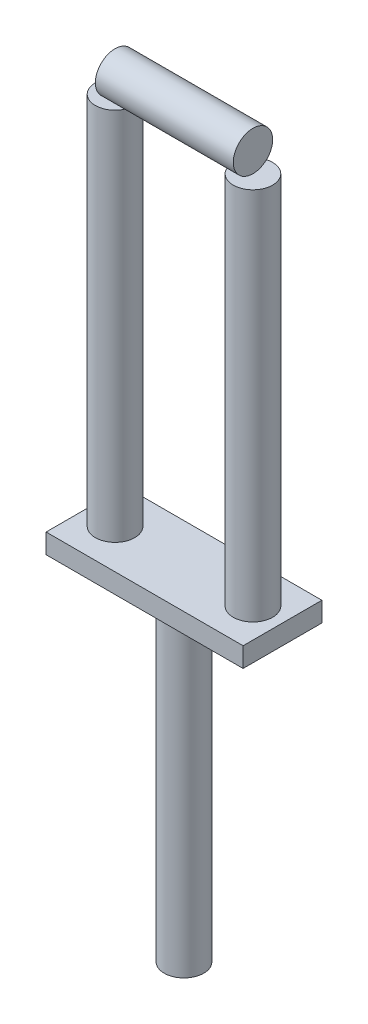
ISO-10303-21;
HEADER;
FILE_DESCRIPTION(('STEP AP214'),'2;1');
FILE_NAME('part.step','',(''),(''),'','','');
FILE_SCHEMA(('AUTOMOTIVE_DESIGN { 1 0 10303 214 1 1 1 1 }'));
ENDSEC;
DATA;
#1=APPLICATION_CONTEXT('core data for automotive mechanical design processes');
#2=APPLICATION_PROTOCOL_DEFINITION('international standard','automotive_design',2000,#1);
#3=PRODUCT_CONTEXT('',#1,'mechanical');
#4=PRODUCT('Part','Part','',(#3));
#5=PRODUCT_RELATED_PRODUCT_CATEGORY('part','',(#4));
#6=PRODUCT_DEFINITION_FORMATION('','',#4);
#7=PRODUCT_DEFINITION_CONTEXT('part definition',#1,'design');
#8=PRODUCT_DEFINITION('design','',#6,#7);
#9=PRODUCT_DEFINITION_SHAPE('','',#8);
#10=(LENGTH_UNIT() NAMED_UNIT(*) SI_UNIT(.MILLI.,.METRE.));
#11=(NAMED_UNIT(*) PLANE_ANGLE_UNIT() SI_UNIT($,.RADIAN.));
#12=(NAMED_UNIT(*) SI_UNIT($,.STERADIAN.) SOLID_ANGLE_UNIT());
#13=UNCERTAINTY_MEASURE_WITH_UNIT(LENGTH_MEASURE(1.E-05),#10,'distance_accuracy_value','');
#14=(GEOMETRIC_REPRESENTATION_CONTEXT(3) GLOBAL_UNCERTAINTY_ASSIGNED_CONTEXT((#13)) GLOBAL_UNIT_ASSIGNED_CONTEXT((#10,
#11,#12)) REPRESENTATION_CONTEXT('',''));
#15=CARTESIAN_POINT('',(0.,0.,0.));
#16=DIRECTION('',(0.,0.,1.));
#17=DIRECTION('',(1.,0.,0.));
#18=AXIS2_PLACEMENT_3D('',#15,#16,#17);
#19=CARTESIAN_POINT('',(-17.5,105.,0.));
#20=DIRECTION('',(1.,0.,0.));
#21=DIRECTION('',(0.,0.,-1.));
#22=AXIS2_PLACEMENT_3D('',#19,#20,#21);
#23=CYLINDRICAL_SURFACE('',#22,5.);
#24=CARTESIAN_POINT('',(-17.5,105.,0.));
#25=DIRECTION('',(-1.,0.,0.));
#26=DIRECTION('',(0.,0.,1.));
#27=AXIS2_PLACEMENT_3D('',#24,#25,#26);
#28=CIRCLE('',#27,5.);
#29=CARTESIAN_POINT('',(-17.5,105.,5.));
#30=VERTEX_POINT('',#29);
#31=EDGE_CURVE('E11',#30,#30,#28,.T.);
#32=ORIENTED_EDGE('',*,*,#31,.F.);
#33=EDGE_LOOP('',(#32));
#34=FACE_BOUND('',#33,.T.);
#35=CARTESIAN_POINT('',(17.5,105.,0.));
#36=DIRECTION('',(-1.,0.,0.));
#37=DIRECTION('',(0.,0.,1.));
#38=AXIS2_PLACEMENT_3D('',#35,#36,#37);
#39=CIRCLE('',#38,5.);
#40=CARTESIAN_POINT('',(17.5,105.,5.));
#41=VERTEX_POINT('',#40);
#42=EDGE_CURVE('E47',#41,#41,#39,.T.);
#43=ORIENTED_EDGE('',*,*,#42,.T.);
#44=EDGE_LOOP('',(#43));
#45=FACE_BOUND('',#44,.T.);
#46=ADVANCED_FACE('F41',(#34,#45),#23,.T.);
#47=CARTESIAN_POINT('',(-17.5,105.,0.));
#48=DIRECTION('',(-1.,0.,0.));
#49=DIRECTION('',(0.,0.,1.));
#50=AXIS2_PLACEMENT_3D('',#47,#48,#49);
#51=PLANE('',#50);
#52=ORIENTED_EDGE('',*,*,#31,.T.);
#53=EDGE_LOOP('',(#52));
#54=FACE_BOUND('',#53,.T.);
#55=ADVANCED_FACE('F56',(#54),#51,.T.);
#56=CARTESIAN_POINT('',(17.5,105.,0.));
#57=DIRECTION('',(-1.,0.,0.));
#58=DIRECTION('',(0.,0.,1.));
#59=AXIS2_PLACEMENT_3D('',#56,#57,#58);
#60=PLANE('',#59);
#61=ORIENTED_EDGE('',*,*,#42,.F.);
#62=EDGE_LOOP('',(#61));
#63=FACE_BOUND('',#62,.T.);
#64=ADVANCED_FACE('F54',(#63),#60,.F.);
#65=CLOSED_SHELL('',(#46,#55,#64));
#66=MANIFOLD_SOLID_BREP('B2',#65);
#67=CARTESIAN_POINT('',(-17.5,5.,0.));
#68=DIRECTION('',(0.,1.,0.));
#69=DIRECTION('',(-1.,0.,0.));
#70=AXIS2_PLACEMENT_3D('',#67,#68,#69);
#71=CYLINDRICAL_SURFACE('',#70,5.);
#72=CARTESIAN_POINT('',(-17.5,5.,0.));
#73=DIRECTION('',(0.,-1.,0.));
#74=DIRECTION('',(1.,0.,0.));
#75=AXIS2_PLACEMENT_3D('',#72,#73,#74);
#76=CIRCLE('',#75,5.);
#77=CARTESIAN_POINT('',(-12.5,5.00000000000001,0.));
#78=VERTEX_POINT('',#77);
#79=EDGE_CURVE('E40',#78,#78,#76,.T.);
#80=ORIENTED_EDGE('',*,*,#79,.F.);
#81=EDGE_LOOP('',(#80));
#82=FACE_BOUND('',#81,.T.);
#83=CARTESIAN_POINT('',(-17.5,100.,0.));
#84=DIRECTION('',(0.,-1.,0.));
#85=DIRECTION('',(1.,0.,0.));
#86=AXIS2_PLACEMENT_3D('',#83,#84,#85);
#87=CIRCLE('',#86,5.);
#88=CARTESIAN_POINT('',(-12.5,100.,0.));
#89=VERTEX_POINT('',#88);
#90=EDGE_CURVE('E101',#89,#89,#87,.T.);
#91=ORIENTED_EDGE('',*,*,#90,.T.);
#92=EDGE_LOOP('',(#91));
#93=FACE_BOUND('',#92,.T.);
#94=ADVANCED_FACE('F95',(#82,#93),#71,.T.);
#95=CARTESIAN_POINT('',(-17.5,5.,0.));
#96=DIRECTION('',(0.,-1.,0.));
#97=DIRECTION('',(1.,0.,0.));
#98=AXIS2_PLACEMENT_3D('',#95,#96,#97);
#99=PLANE('',#98);
#100=ORIENTED_EDGE('',*,*,#79,.T.);
#101=EDGE_LOOP('',(#100));
#102=FACE_BOUND('',#101,.T.);
#103=ADVANCED_FACE('F110',(#102),#99,.T.);
#104=CARTESIAN_POINT('',(-17.5,100.,0.));
#105=DIRECTION('',(0.,-1.,0.));
#106=DIRECTION('',(1.,0.,0.));
#107=AXIS2_PLACEMENT_3D('',#104,#105,#106);
#108=PLANE('',#107);
#109=ORIENTED_EDGE('',*,*,#90,.F.);
#110=EDGE_LOOP('',(#109));
#111=FACE_BOUND('',#110,.T.);
#112=ADVANCED_FACE('F108',(#111),#108,.F.);
#113=CLOSED_SHELL('',(#94,#103,#112));
#114=MANIFOLD_SOLID_BREP('B6',#113);
#115=CARTESIAN_POINT('',(17.5,5.,0.));
#116=DIRECTION('',(0.,1.,0.));
#117=DIRECTION('',(-1.,0.,0.));
#118=AXIS2_PLACEMENT_3D('',#115,#116,#117);
#119=CYLINDRICAL_SURFACE('',#118,5.);
#120=CARTESIAN_POINT('',(17.5,5.,0.));
#121=DIRECTION('',(0.,-1.,0.));
#122=DIRECTION('',(1.,0.,0.));
#123=AXIS2_PLACEMENT_3D('',#120,#121,#122);
#124=CIRCLE('',#123,5.);
#125=CARTESIAN_POINT('',(22.5,5.00000000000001,0.));
#126=VERTEX_POINT('',#125);
#127=EDGE_CURVE('E94',#126,#126,#124,.T.);
#128=ORIENTED_EDGE('',*,*,#127,.F.);
#129=EDGE_LOOP('',(#128));
#130=FACE_BOUND('',#129,.T.);
#131=CARTESIAN_POINT('',(17.5,100.,0.));
#132=DIRECTION('',(0.,-1.,0.));
#133=DIRECTION('',(1.,0.,0.));
#134=AXIS2_PLACEMENT_3D('',#131,#132,#133);
#135=CIRCLE('',#134,5.);
#136=CARTESIAN_POINT('',(22.5,100.,0.));
#137=VERTEX_POINT('',#136);
#138=EDGE_CURVE('E155',#137,#137,#135,.T.);
#139=ORIENTED_EDGE('',*,*,#138,.T.);
#140=EDGE_LOOP('',(#139));
#141=FACE_BOUND('',#140,.T.);
#142=ADVANCED_FACE('F149',(#130,#141),#119,.T.);
#143=CARTESIAN_POINT('',(17.5,5.,0.));
#144=DIRECTION('',(0.,-1.,0.));
#145=DIRECTION('',(1.,0.,0.));
#146=AXIS2_PLACEMENT_3D('',#143,#144,#145);
#147=PLANE('',#146);
#148=ORIENTED_EDGE('',*,*,#127,.T.);
#149=EDGE_LOOP('',(#148));
#150=FACE_BOUND('',#149,.T.);
#151=ADVANCED_FACE('F164',(#150),#147,.T.);
#152=CARTESIAN_POINT('',(17.5,100.,0.));
#153=DIRECTION('',(0.,-1.,0.));
#154=DIRECTION('',(1.,0.,0.));
#155=AXIS2_PLACEMENT_3D('',#152,#153,#154);
#156=PLANE('',#155);
#157=ORIENTED_EDGE('',*,*,#138,.F.);
#158=EDGE_LOOP('',(#157));
#159=FACE_BOUND('',#158,.T.);
#160=ADVANCED_FACE('F162',(#159),#156,.F.);
#161=CLOSED_SHELL('',(#142,#151,#160));
#162=MANIFOLD_SOLID_BREP('B35',#161);
#163=CARTESIAN_POINT('',(0.,-82.,0.));
#164=DIRECTION('',(0.,1.,0.));
#165=DIRECTION('',(-1.,0.,0.));
#166=AXIS2_PLACEMENT_3D('',#163,#164,#165);
#167=CYLINDRICAL_SURFACE('',#166,5.);
#168=CARTESIAN_POINT('',(0.,-82.,0.));
#169=DIRECTION('',(0.,-1.,0.));
#170=DIRECTION('',(1.,0.,0.));
#171=AXIS2_PLACEMENT_3D('',#168,#169,#170);
#172=CIRCLE('',#171,5.);
#173=CARTESIAN_POINT('',(-4.99999999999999,-82.,0.));
#174=VERTEX_POINT('',#173);
#175=EDGE_CURVE('E148',#174,#174,#172,.T.);
#176=CARTESIAN_POINT('',(0.,0.,0.));
#177=DIRECTION('',(0.,-1.,0.));
#178=DIRECTION('',(1.,0.,0.));
#179=AXIS2_PLACEMENT_3D('',#176,#177,#178);
#180=CIRCLE('',#179,5.);
#181=CARTESIAN_POINT('',(-5.,0.,0.));
#182=VERTEX_POINT('',#181);
#183=EDGE_CURVE('E210',#182,#182,#180,.T.);
#184=CARTESIAN_POINT('',(-4.99999999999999,-82.,0.));
#185=CARTESIAN_POINT('',(-4.99999999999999,-81.1458333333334,0.));
#186=CARTESIAN_POINT('',(-4.99999999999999,-80.2916666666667,0.));
#187=CARTESIAN_POINT('',(-4.99999999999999,-78.5833333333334,0.));
#188=CARTESIAN_POINT('',(-4.99999999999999,-77.7291666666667,0.));
#189=CARTESIAN_POINT('',(-4.99999999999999,-76.0208333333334,0.));
#190=CARTESIAN_POINT('',(-4.99999999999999,-75.1666666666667,0.));
#191=CARTESIAN_POINT('',(-4.99999999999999,-73.4583333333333,0.));
#192=CARTESIAN_POINT('',(-4.99999999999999,-72.6041666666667,0.));
#193=CARTESIAN_POINT('',(-4.99999999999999,-70.8958333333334,0.));
#194=CARTESIAN_POINT('',(-4.99999999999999,-70.0416666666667,0.));
#195=CARTESIAN_POINT('',(-4.99999999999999,-68.3333333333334,0.));
#196=CARTESIAN_POINT('',(-4.99999999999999,-67.4791666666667,0.));
#197=CARTESIAN_POINT('',(-4.99999999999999,-65.7708333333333,0.));
#198=CARTESIAN_POINT('',(-4.99999999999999,-64.9166666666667,0.));
#199=CARTESIAN_POINT('',(-4.99999999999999,-63.2083333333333,0.));
#200=CARTESIAN_POINT('',(-4.99999999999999,-62.3541666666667,0.));
#201=CARTESIAN_POINT('',(-4.99999999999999,-60.6458333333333,0.));
#202=CARTESIAN_POINT('',(-4.99999999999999,-59.7916666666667,0.));
#203=CARTESIAN_POINT('',(-4.99999999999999,-58.0833333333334,0.));
#204=CARTESIAN_POINT('',(-4.99999999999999,-57.2291666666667,0.));
#205=CARTESIAN_POINT('',(-4.99999999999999,-55.5208333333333,0.));
#206=CARTESIAN_POINT('',(-4.99999999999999,-54.6666666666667,0.));
#207=CARTESIAN_POINT('',(-4.99999999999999,-52.9583333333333,0.));
#208=CARTESIAN_POINT('',(-4.99999999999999,-52.1041666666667,0.));
#209=CARTESIAN_POINT('',(-4.99999999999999,-50.3958333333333,0.));
#210=CARTESIAN_POINT('',(-4.99999999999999,-49.5416666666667,0.));
#211=CARTESIAN_POINT('',(-4.99999999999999,-47.8333333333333,0.));
#212=CARTESIAN_POINT('',(-4.99999999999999,-46.9791666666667,0.));
#213=CARTESIAN_POINT('',(-4.99999999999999,-45.2708333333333,0.));
#214=CARTESIAN_POINT('',(-4.99999999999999,-44.4166666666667,0.));
#215=CARTESIAN_POINT('',(-4.99999999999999,-42.7083333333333,0.));
#216=CARTESIAN_POINT('',(-4.99999999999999,-41.8541666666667,0.));
#217=CARTESIAN_POINT('',(-4.99999999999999,-40.1458333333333,0.));
#218=CARTESIAN_POINT('',(-4.99999999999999,-39.2916666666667,0.));
#219=CARTESIAN_POINT('',(-4.99999999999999,-37.5833333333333,0.));
#220=CARTESIAN_POINT('',(-5.,-36.7291666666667,0.));
#221=CARTESIAN_POINT('',(-5.,-35.0208333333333,0.));
#222=CARTESIAN_POINT('',(-5.,-34.1666666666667,0.));
#223=CARTESIAN_POINT('',(-5.,-32.4583333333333,0.));
#224=CARTESIAN_POINT('',(-5.,-31.6041666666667,0.));
#225=CARTESIAN_POINT('',(-5.,-29.8958333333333,0.));
#226=CARTESIAN_POINT('',(-5.,-29.0416666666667,0.));
#227=CARTESIAN_POINT('',(-5.,-27.3333333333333,0.));
#228=CARTESIAN_POINT('',(-5.,-26.4791666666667,0.));
#229=CARTESIAN_POINT('',(-5.,-24.7708333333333,0.));
#230=CARTESIAN_POINT('',(-5.,-23.9166666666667,0.));
#231=CARTESIAN_POINT('',(-5.,-22.2083333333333,0.));
#232=CARTESIAN_POINT('',(-5.,-21.3541666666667,0.));
#233=CARTESIAN_POINT('',(-5.,-19.6458333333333,0.));
#234=CARTESIAN_POINT('',(-5.,-18.7916666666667,0.));
#235=CARTESIAN_POINT('',(-5.,-17.0833333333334,0.));
#236=CARTESIAN_POINT('',(-5.,-16.2291666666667,0.));
#237=CARTESIAN_POINT('',(-5.,-14.5208333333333,0.));
#238=CARTESIAN_POINT('',(-5.,-13.6666666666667,0.));
#239=CARTESIAN_POINT('',(-5.,-11.9583333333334,0.));
#240=CARTESIAN_POINT('',(-5.,-11.1041666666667,0.));
#241=CARTESIAN_POINT('',(-5.,-9.39583333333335,0.));
#242=CARTESIAN_POINT('',(-5.,-8.54166666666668,0.));
#243=CARTESIAN_POINT('',(-5.,-6.83333333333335,0.));
#244=CARTESIAN_POINT('',(-5.,-5.97916666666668,0.));
#245=CARTESIAN_POINT('',(-5.,-4.27083333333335,0.));
#246=CARTESIAN_POINT('',(-5.,-3.41666666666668,0.));
#247=CARTESIAN_POINT('',(-5.,-1.70833333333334,0.));
#248=CARTESIAN_POINT('',(-5.,-0.854166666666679,0.));
#249=CARTESIAN_POINT('',(-5.,0.,0.));
#250=B_SPLINE_CURVE_WITH_KNOTS('',3,(#184,#185,#186,#187,#188,#189,#190,#191,#192,#193,#194,
#195,#196,#197,#198,#199,#200,#201,#202,#203,#204,#205,#206,#207,#208,#209,#210,#211,#212,#213,
#214,#215,#216,#217,#218,#219,#220,#221,#222,#223,#224,#225,#226,#227,#228,#229,#230,#231,#232,
#233,#234,#235,#236,#237,#238,#239,#240,#241,#242,#243,#244,#245,#246,#247,#248,#249),
.UNSPECIFIED.,.F.,.F.,(4,2,2,2,2,2,2,2,2,2,2,2,2,2,2,2,2,2,2,2,2,2,2,2,2,2,2,2,2,2,2,2,4),(0.,
2.56250000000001,5.125,7.68750000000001,10.25,12.8125,15.375,17.9375,20.5,23.0625,25.625,
28.1875,30.75,33.3125,35.875,38.4375,41.,43.5625,46.125,48.6875,51.25,53.8125,56.375,58.9375,
61.5,64.0625,66.625,69.1875,71.75,74.3125,76.875,79.4375,82.),.UNSPECIFIED.);
#251=EDGE_CURVE('BSEAM204',#174,#182,#250,.T.);
#252=ORIENTED_EDGE('',*,*,#175,.F.);
#253=ORIENTED_EDGE('',*,*,#183,.T.);
#254=ORIENTED_EDGE('',*,*,#251,.T.);
#255=ORIENTED_EDGE('',*,*,#251,.F.);
#256=EDGE_LOOP('',(#252,#254,#253,#255));
#257=FACE_BOUND('',#256,.T.);
#258=ADVANCED_FACE('F204',(#257),#167,.T.);
#259=CARTESIAN_POINT('',(0.,-82.,0.));
#260=DIRECTION('',(0.,-1.,0.));
#261=DIRECTION('',(1.,0.,0.));
#262=AXIS2_PLACEMENT_3D('',#259,#260,#261);
#263=PLANE('',#262);
#264=ORIENTED_EDGE('',*,*,#175,.T.);
#265=EDGE_LOOP('',(#264));
#266=FACE_BOUND('',#265,.T.);
#267=ADVANCED_FACE('F219',(#266),#263,.T.);
#268=CARTESIAN_POINT('',(0.,0.,0.));
#269=DIRECTION('',(0.,-1.,0.));
#270=DIRECTION('',(1.,0.,0.));
#271=AXIS2_PLACEMENT_3D('',#268,#269,#270);
#272=PLANE('',#271);
#273=ORIENTED_EDGE('',*,*,#183,.F.);
#274=EDGE_LOOP('',(#273));
#275=FACE_BOUND('',#274,.T.);
#276=ADVANCED_FACE('F217',(#275),#272,.F.);
#277=CLOSED_SHELL('',(#258,#267,#276));
#278=MANIFOLD_SOLID_BREP('B89',#277);
#279=CARTESIAN_POINT('',(25.,4.99999999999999,10.));
#280=DIRECTION('',(0.,0.,-1.));
#281=DIRECTION('',(-1.,0.,0.));
#282=AXIS2_PLACEMENT_3D('',#279,#280,#281);
#283=PLANE('',#282);
#284=DIRECTION('',(0.,-1.,0.));
#285=VECTOR('',#284,1.);
#286=CARTESIAN_POINT('',(-25.,4.99999999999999,10.));
#287=LINE('',#286,#285);
#288=CARTESIAN_POINT('',(-25.,4.99999999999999,10.));
#289=VERTEX_POINT('',#288);
#290=CARTESIAN_POINT('',(-25.,0.,10.));
#291=VERTEX_POINT('',#290);
#292=EDGE_CURVE('E294',#289,#291,#287,.T.);
#293=ORIENTED_EDGE('',*,*,#292,.T.);
#294=DIRECTION('',(-1.,0.,0.));
#295=VECTOR('',#294,1.);
#296=CARTESIAN_POINT('',(25.,0.,10.));
#297=LINE('',#296,#295);
#298=CARTESIAN_POINT('',(25.,0.,10.));
#299=VERTEX_POINT('',#298);
#300=EDGE_CURVE('E202',#299,#291,#297,.T.);
#301=ORIENTED_EDGE('',*,*,#300,.F.);
#302=DIRECTION('',(0.,-1.,0.));
#303=VECTOR('',#302,1.);
#304=CARTESIAN_POINT('',(25.,4.99999999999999,10.));
#305=LINE('',#304,#303);
#306=CARTESIAN_POINT('',(25.,4.99999999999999,10.));
#307=VERTEX_POINT('',#306);
#308=EDGE_CURVE('E312',#307,#299,#305,.T.);
#309=ORIENTED_EDGE('',*,*,#308,.F.);
#310=DIRECTION('',(-1.,0.,0.));
#311=VECTOR('',#310,1.);
#312=CARTESIAN_POINT('',(25.,4.99999999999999,10.));
#313=LINE('',#312,#311);
#314=EDGE_CURVE('E306',#307,#289,#313,.T.);
#315=ORIENTED_EDGE('',*,*,#314,.T.);
#316=EDGE_LOOP('',(#293,#301,#309,#315));
#317=FACE_BOUND('',#316,.T.);
#318=ADVANCED_FACE('F250',(#317),#283,.F.);
#319=CARTESIAN_POINT('',(25.,0.,10.));
#320=DIRECTION('',(0.,1.,0.));
#321=DIRECTION('',(0.,0.,1.));
#322=AXIS2_PLACEMENT_3D('',#319,#320,#321);
#323=PLANE('',#322);
#324=DIRECTION('',(0.,0.,-1.));
#325=VECTOR('',#324,1.);
#326=CARTESIAN_POINT('',(-25.,0.,10.));
#327=LINE('',#326,#325);
#328=CARTESIAN_POINT('',(-25.,0.,-10.));
#329=VERTEX_POINT('',#328);
#330=EDGE_CURVE('E290',#291,#329,#327,.T.);
#331=ORIENTED_EDGE('',*,*,#330,.T.);
#332=DIRECTION('',(-1.,0.,0.));
#333=VECTOR('',#332,1.);
#334=CARTESIAN_POINT('',(25.,0.,-10.));
#335=LINE('',#334,#333);
#336=CARTESIAN_POINT('',(25.,0.,-10.));
#337=VERTEX_POINT('',#336);
#338=EDGE_CURVE('E257',#337,#329,#335,.T.);
#339=ORIENTED_EDGE('',*,*,#338,.F.);
#340=DIRECTION('',(0.,0.,-1.));
#341=VECTOR('',#340,1.);
#342=CARTESIAN_POINT('',(25.,0.,10.));
#343=LINE('',#342,#341);
#344=EDGE_CURVE('E302',#299,#337,#343,.T.);
#345=ORIENTED_EDGE('',*,*,#344,.F.);
#346=ORIENTED_EDGE('',*,*,#300,.T.);
#347=EDGE_LOOP('',(#331,#339,#345,#346));
#348=FACE_BOUND('',#347,.T.);
#349=ADVANCED_FACE('F301',(#348),#323,.F.);
#350=CARTESIAN_POINT('',(25.,5.,-10.));
#351=DIRECTION('',(0.,0.,1.));
#352=DIRECTION('',(1.,0.,0.));
#353=AXIS2_PLACEMENT_3D('',#350,#351,#352);
#354=PLANE('',#353);
#355=DIRECTION('',(0.,1.,0.));
#356=VECTOR('',#355,1.);
#357=CARTESIAN_POINT('',(-25.,5.,-10.));
#358=LINE('',#357,#356);
#359=CARTESIAN_POINT('',(-25.,5.,-10.));
#360=VERTEX_POINT('',#359);
#361=EDGE_CURVE('E295',#329,#360,#358,.T.);
#362=ORIENTED_EDGE('',*,*,#361,.T.);
#363=DIRECTION('',(-1.,0.,0.));
#364=VECTOR('',#363,1.);
#365=CARTESIAN_POINT('',(25.,5.,-10.));
#366=LINE('',#365,#364);
#367=CARTESIAN_POINT('',(25.,5.,-10.));
#368=VERTEX_POINT('',#367);
#369=EDGE_CURVE('E318',#368,#360,#366,.T.);
#370=ORIENTED_EDGE('',*,*,#369,.F.);
#371=DIRECTION('',(0.,1.,0.));
#372=VECTOR('',#371,1.);
#373=CARTESIAN_POINT('',(25.,5.,-10.));
#374=LINE('',#373,#372);
#375=EDGE_CURVE('E269',#337,#368,#374,.T.);
#376=ORIENTED_EDGE('',*,*,#375,.F.);
#377=ORIENTED_EDGE('',*,*,#338,.T.);
#378=EDGE_LOOP('',(#362,#370,#376,#377));
#379=FACE_BOUND('',#378,.T.);
#380=ADVANCED_FACE('F321',(#379),#354,.F.);
#381=CARTESIAN_POINT('',(25.,4.99999999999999,10.));
#382=DIRECTION('',(0.,-1.,0.));
#383=DIRECTION('',(0.,0.,-1.));
#384=AXIS2_PLACEMENT_3D('',#381,#382,#383);
#385=PLANE('',#384);
#386=DIRECTION('',(0.,0.,1.));
#387=VECTOR('',#386,1.);
#388=CARTESIAN_POINT('',(-25.,4.99999999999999,10.));
#389=LINE('',#388,#387);
#390=EDGE_CURVE('E310',#360,#289,#389,.T.);
#391=ORIENTED_EDGE('',*,*,#390,.T.);
#392=ORIENTED_EDGE('',*,*,#314,.F.);
#393=DIRECTION('',(0.,0.,1.));
#394=VECTOR('',#393,1.);
#395=CARTESIAN_POINT('',(25.,4.99999999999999,10.));
#396=LINE('',#395,#394);
#397=EDGE_CURVE('E264',#368,#307,#396,.T.);
#398=ORIENTED_EDGE('',*,*,#397,.F.);
#399=ORIENTED_EDGE('',*,*,#369,.T.);
#400=EDGE_LOOP('',(#391,#392,#398,#399));
#401=FACE_BOUND('',#400,.T.);
#402=ADVANCED_FACE('F323',(#401),#385,.F.);
#403=CARTESIAN_POINT('',(25.,0.,10.));
#404=DIRECTION('',(1.,0.,0.));
#405=DIRECTION('',(0.,0.,-1.));
#406=AXIS2_PLACEMENT_3D('',#403,#404,#405);
#407=PLANE('',#406);
#408=ORIENTED_EDGE('',*,*,#308,.T.);
#409=ORIENTED_EDGE('',*,*,#344,.T.);
#410=ORIENTED_EDGE('',*,*,#375,.T.);
#411=ORIENTED_EDGE('',*,*,#397,.T.);
#412=EDGE_LOOP('',(#408,#409,#410,#411));
#413=FACE_BOUND('',#412,.T.);
#414=ADVANCED_FACE('F324',(#413),#407,.T.);
#415=CARTESIAN_POINT('',(-25.,0.,10.));
#416=DIRECTION('',(1.,0.,0.));
#417=DIRECTION('',(0.,0.,-1.));
#418=AXIS2_PLACEMENT_3D('',#415,#416,#417);
#419=PLANE('',#418);
#420=ORIENTED_EDGE('',*,*,#292,.F.);
#421=ORIENTED_EDGE('',*,*,#390,.F.);
#422=ORIENTED_EDGE('',*,*,#361,.F.);
#423=ORIENTED_EDGE('',*,*,#330,.F.);
#424=EDGE_LOOP('',(#420,#421,#422,#423));
#425=FACE_BOUND('',#424,.T.);
#426=ADVANCED_FACE('F291',(#425),#419,.F.);
#427=CLOSED_SHELL('',(#318,#349,#380,#402,#414,#426));
#428=MANIFOLD_SOLID_BREP('B143',#427);
#429=ADVANCED_BREP_SHAPE_REPRESENTATION('',(#18,#66,#114,#162,#278,#428),#14);
#430=SHAPE_DEFINITION_REPRESENTATION(#9,#429);
ENDSEC;
END-ISO-10303-21;
